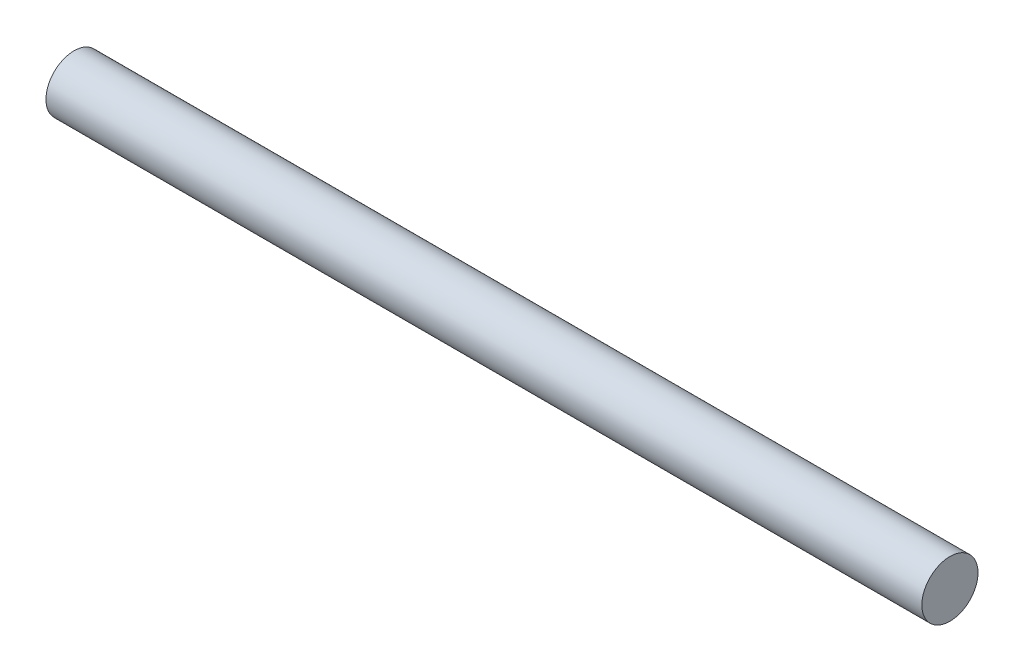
ISO-10303-21;
HEADER;
FILE_DESCRIPTION(('STEP AP214'),'2;1');
FILE_NAME('part.step','',(''),(''),'','','');
FILE_SCHEMA(('AUTOMOTIVE_DESIGN { 1 0 10303 214 1 1 1 1 }'));
ENDSEC;
DATA;
#1=APPLICATION_CONTEXT('core data for automotive mechanical design processes');
#2=APPLICATION_PROTOCOL_DEFINITION('international standard','automotive_design',2000,#1);
#3=PRODUCT_CONTEXT('',#1,'mechanical');
#4=PRODUCT('Part','Part','',(#3));
#5=PRODUCT_RELATED_PRODUCT_CATEGORY('part','',(#4));
#6=PRODUCT_DEFINITION_FORMATION('','',#4);
#7=PRODUCT_DEFINITION_CONTEXT('part definition',#1,'design');
#8=PRODUCT_DEFINITION('design','',#6,#7);
#9=PRODUCT_DEFINITION_SHAPE('','',#8);
#10=(LENGTH_UNIT() NAMED_UNIT(*) SI_UNIT(.MILLI.,.METRE.));
#11=(NAMED_UNIT(*) PLANE_ANGLE_UNIT() SI_UNIT($,.RADIAN.));
#12=(NAMED_UNIT(*) SI_UNIT($,.STERADIAN.) SOLID_ANGLE_UNIT());
#13=UNCERTAINTY_MEASURE_WITH_UNIT(LENGTH_MEASURE(1.E-05),#10,'distance_accuracy_value','');
#14=(GEOMETRIC_REPRESENTATION_CONTEXT(3) GLOBAL_UNCERTAINTY_ASSIGNED_CONTEXT((#13)) GLOBAL_UNIT_ASSIGNED_CONTEXT((#10,
#11,#12)) REPRESENTATION_CONTEXT('',''));
#15=CARTESIAN_POINT('',(0.,0.,0.));
#16=DIRECTION('',(0.,0.,1.));
#17=DIRECTION('',(1.,0.,0.));
#18=AXIS2_PLACEMENT_3D('',#15,#16,#17);
#19=CARTESIAN_POINT('',(99.06,0.,0.));
#20=DIRECTION('',(-1.,0.,0.));
#21=DIRECTION('',(0.,0.,1.));
#22=AXIS2_PLACEMENT_3D('',#19,#20,#21);
#23=CYLINDRICAL_SURFACE('',#22,3.175);
#24=CARTESIAN_POINT('',(99.06,0.,0.));
#25=DIRECTION('',(1.,0.,0.));
#26=DIRECTION('',(0.,0.,-1.));
#27=AXIS2_PLACEMENT_3D('',#24,#25,#26);
#28=CIRCLE('',#27,3.175);
#29=CARTESIAN_POINT('',(99.06,0.,-3.175));
#30=VERTEX_POINT('',#29);
#31=EDGE_CURVE('E10',#30,#30,#28,.T.);
#32=ORIENTED_EDGE('',*,*,#31,.F.);
#33=EDGE_LOOP('',(#32));
#34=FACE_BOUND('',#33,.T.);
#35=CARTESIAN_POINT('',(0.,0.,0.));
#36=DIRECTION('',(1.,0.,0.));
#37=DIRECTION('',(0.,0.,-1.));
#38=AXIS2_PLACEMENT_3D('',#35,#36,#37);
#39=CIRCLE('',#38,3.175);
#40=CARTESIAN_POINT('',(0.,0.,-3.175));
#41=VERTEX_POINT('',#40);
#42=EDGE_CURVE('E42',#41,#41,#39,.T.);
#43=ORIENTED_EDGE('',*,*,#42,.T.);
#44=EDGE_LOOP('',(#43));
#45=FACE_BOUND('',#44,.T.);
#46=ADVANCED_FACE('F41',(#34,#45),#23,.T.);
#47=CARTESIAN_POINT('',(99.06,0.,0.));
#48=DIRECTION('',(1.,0.,0.));
#49=DIRECTION('',(0.,0.,-1.));
#50=AXIS2_PLACEMENT_3D('',#47,#48,#49);
#51=PLANE('',#50);
#52=ORIENTED_EDGE('',*,*,#31,.T.);
#53=EDGE_LOOP('',(#52));
#54=FACE_BOUND('',#53,.T.);
#55=ADVANCED_FACE('F58',(#54),#51,.T.);
#56=CARTESIAN_POINT('',(0.,0.,0.));
#57=DIRECTION('',(1.,0.,0.));
#58=DIRECTION('',(0.,0.,-1.));
#59=AXIS2_PLACEMENT_3D('',#56,#57,#58);
#60=PLANE('',#59);
#61=ORIENTED_EDGE('',*,*,#42,.F.);
#62=EDGE_LOOP('',(#61));
#63=FACE_BOUND('',#62,.T.);
#64=ADVANCED_FACE('F59',(#63),#60,.F.);
#65=CLOSED_SHELL('',(#46,#55,#64));
#66=MANIFOLD_SOLID_BREP('B2',#65);
#67=ADVANCED_BREP_SHAPE_REPRESENTATION('',(#18,#66),#14);
#68=SHAPE_DEFINITION_REPRESENTATION(#9,#67);
ENDSEC;
END-ISO-10303-21;
